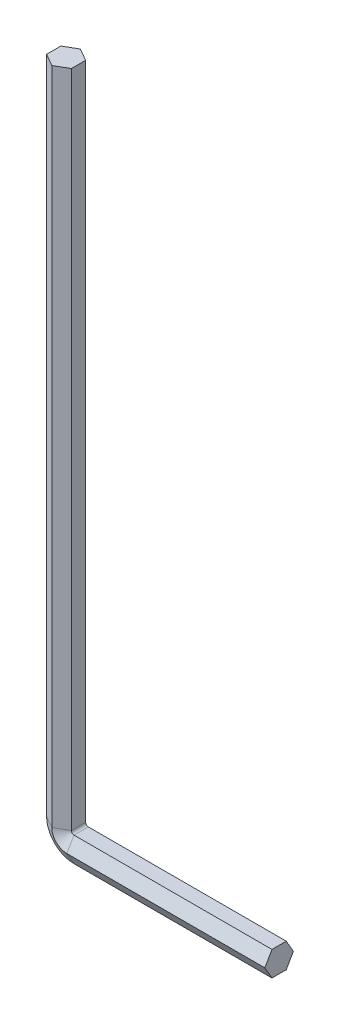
ISO-10303-21;
HEADER;
FILE_DESCRIPTION(('STEP AP214'),'2;1');
FILE_NAME('part.step','',(''),(''),'','','');
FILE_SCHEMA(('AUTOMOTIVE_DESIGN { 1 0 10303 214 1 1 1 1 }'));
ENDSEC;
DATA;
#1=APPLICATION_CONTEXT('core data for automotive mechanical design processes');
#2=APPLICATION_PROTOCOL_DEFINITION('international standard','automotive_design',2000,#1);
#3=PRODUCT_CONTEXT('',#1,'mechanical');
#4=PRODUCT('Part','Part','',(#3));
#5=PRODUCT_RELATED_PRODUCT_CATEGORY('part','',(#4));
#6=PRODUCT_DEFINITION_FORMATION('','',#4);
#7=PRODUCT_DEFINITION_CONTEXT('part definition',#1,'design');
#8=PRODUCT_DEFINITION('design','',#6,#7);
#9=PRODUCT_DEFINITION_SHAPE('','',#8);
#10=(LENGTH_UNIT() NAMED_UNIT(*) SI_UNIT(.MILLI.,.METRE.));
#11=(NAMED_UNIT(*) PLANE_ANGLE_UNIT() SI_UNIT($,.RADIAN.));
#12=(NAMED_UNIT(*) SI_UNIT($,.STERADIAN.) SOLID_ANGLE_UNIT());
#13=UNCERTAINTY_MEASURE_WITH_UNIT(LENGTH_MEASURE(1.E-05),#10,'distance_accuracy_value','');
#14=(GEOMETRIC_REPRESENTATION_CONTEXT(3) GLOBAL_UNCERTAINTY_ASSIGNED_CONTEXT((#13)) GLOBAL_UNIT_ASSIGNED_CONTEXT((#10,
#11,#12)) REPRESENTATION_CONTEXT('',''));
#15=CARTESIAN_POINT('',(0.,0.,0.));
#16=DIRECTION('',(0.,0.,1.));
#17=DIRECTION('',(1.,0.,0.));
#18=AXIS2_PLACEMENT_3D('',#15,#16,#17);
#19=CARTESIAN_POINT('',(-21.6857790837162,1.44515408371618,0.687407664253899));
#20=DIRECTION('',(1.,0.,0.));
#21=DIRECTION('',(0.,0.,-1.));
#22=AXIS2_PLACEMENT_3D('',#19,#20,#21);
#23=PLANE('',#22);
#24=DIRECTION('',(0.,0.,-1.));
#25=VECTOR('',#24,1.);
#26=CARTESIAN_POINT('',(-21.6857790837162,1.44515408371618,0.687407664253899));
#27=LINE('',#26,#25);
#28=CARTESIAN_POINT('',(-21.6857790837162,1.44515408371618,0.687407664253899));
#29=VERTEX_POINT('',#28);
#30=CARTESIAN_POINT('',(-21.6857790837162,1.44515408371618,-0.687407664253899));
#31=VERTEX_POINT('',#30);
#32=EDGE_CURVE('E195',#29,#31,#27,.T.);
#33=ORIENTED_EDGE('',*,*,#32,.F.);
#34=DIRECTION('',(0.,1.,0.));
#35=VECTOR('',#34,1.);
#36=CARTESIAN_POINT('',(-21.6857790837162,1.44515408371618,0.687407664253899));
#37=LINE('',#36,#35);
#38=CARTESIAN_POINT('',(-21.6857790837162,64.9451540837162,0.687407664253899));
#39=VERTEX_POINT('',#38);
#40=EDGE_CURVE('E38',#29,#39,#37,.T.);
#41=ORIENTED_EDGE('',*,*,#40,.T.);
#42=DIRECTION('',(0.,0.,-1.));
#43=VECTOR('',#42,1.);
#44=CARTESIAN_POINT('',(-21.6857790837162,64.9451540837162,0.687407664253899));
#45=LINE('',#44,#43);
#46=CARTESIAN_POINT('',(-21.6857790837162,64.9451540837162,-0.687407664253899));
#47=VERTEX_POINT('',#46);
#48=EDGE_CURVE('E45',#39,#47,#45,.T.);
#49=ORIENTED_EDGE('',*,*,#48,.T.);
#50=DIRECTION('',(0.,1.,0.));
#51=VECTOR('',#50,1.);
#52=CARTESIAN_POINT('',(-21.6857790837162,1.44515408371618,-0.687407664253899));
#53=LINE('',#52,#51);
#54=EDGE_CURVE('E11',#31,#47,#53,.T.);
#55=ORIENTED_EDGE('',*,*,#54,.F.);
#56=EDGE_LOOP('',(#33,#41,#49,#55));
#57=FACE_BOUND('',#56,.T.);
#58=ADVANCED_FACE('F31',(#57),#23,.F.);
#59=CARTESIAN_POINT('',(-20.4951540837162,1.44515408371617,1.3748153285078));
#60=DIRECTION('',(0.5,0.,-0.866025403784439));
#61=DIRECTION('',(-0.866025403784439,0.,-0.5));
#62=AXIS2_PLACEMENT_3D('',#59,#60,#61);
#63=PLANE('',#62);
#64=DIRECTION('',(-0.866025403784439,0.,-0.5));
#65=VECTOR('',#64,1.);
#66=CARTESIAN_POINT('',(-20.4951540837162,1.44515408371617,1.3748153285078));
#67=LINE('',#66,#65);
#68=CARTESIAN_POINT('',(-20.4951540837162,1.44515408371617,1.3748153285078));
#69=VERTEX_POINT('',#68);
#70=EDGE_CURVE('E192',#69,#29,#67,.T.);
#71=ORIENTED_EDGE('',*,*,#70,.F.);
#72=DIRECTION('',(0.,1.,0.));
#73=VECTOR('',#72,1.);
#74=CARTESIAN_POINT('',(-20.4951540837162,1.44515408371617,1.3748153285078));
#75=LINE('',#74,#73);
#76=CARTESIAN_POINT('',(-20.4951540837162,64.9451540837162,1.3748153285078));
#77=VERTEX_POINT('',#76);
#78=EDGE_CURVE('E235',#69,#77,#75,.T.);
#79=ORIENTED_EDGE('',*,*,#78,.T.);
#80=DIRECTION('',(-0.866025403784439,0.,-0.5));
#81=VECTOR('',#80,1.);
#82=CARTESIAN_POINT('',(-20.4951540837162,64.9451540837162,1.3748153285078));
#83=LINE('',#82,#81);
#84=EDGE_CURVE('E53',#77,#39,#83,.T.);
#85=ORIENTED_EDGE('',*,*,#84,.T.);
#86=ORIENTED_EDGE('',*,*,#40,.F.);
#87=EDGE_LOOP('',(#71,#79,#85,#86));
#88=FACE_BOUND('',#87,.T.);
#89=ADVANCED_FACE('F238',(#88),#63,.F.);
#90=CARTESIAN_POINT('',(-19.3045290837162,1.44515408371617,0.687407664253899));
#91=DIRECTION('',(-0.5,0.,-0.866025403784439));
#92=DIRECTION('',(-0.866025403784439,0.,0.5));
#93=AXIS2_PLACEMENT_3D('',#90,#91,#92);
#94=PLANE('',#93);
#95=DIRECTION('',(-0.866025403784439,0.,0.5));
#96=VECTOR('',#95,1.);
#97=CARTESIAN_POINT('',(-19.3045290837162,1.44515408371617,0.687407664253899));
#98=LINE('',#97,#96);
#99=CARTESIAN_POINT('',(-19.3045290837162,1.44515408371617,0.687407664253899));
#100=VERTEX_POINT('',#99);
#101=EDGE_CURVE('E189',#100,#69,#98,.T.);
#102=ORIENTED_EDGE('',*,*,#101,.F.);
#103=DIRECTION('',(0.,1.,0.));
#104=VECTOR('',#103,1.);
#105=CARTESIAN_POINT('',(-19.3045290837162,1.44515408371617,0.687407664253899));
#106=LINE('',#105,#104);
#107=CARTESIAN_POINT('',(-19.3045290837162,64.9451540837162,0.687407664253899));
#108=VERTEX_POINT('',#107);
#109=EDGE_CURVE('E232',#100,#108,#106,.T.);
#110=ORIENTED_EDGE('',*,*,#109,.T.);
#111=DIRECTION('',(-0.866025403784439,0.,0.5));
#112=VECTOR('',#111,1.);
#113=CARTESIAN_POINT('',(-19.3045290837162,64.9451540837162,0.687407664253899));
#114=LINE('',#113,#112);
#115=EDGE_CURVE('E222',#108,#77,#114,.T.);
#116=ORIENTED_EDGE('',*,*,#115,.T.);
#117=ORIENTED_EDGE('',*,*,#78,.F.);
#118=EDGE_LOOP('',(#102,#110,#116,#117));
#119=FACE_BOUND('',#118,.T.);
#120=ADVANCED_FACE('F293',(#119),#94,.F.);
#121=CARTESIAN_POINT('',(-19.3045290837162,1.44515408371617,-0.687407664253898));
#122=DIRECTION('',(-1.,0.,0.));
#123=DIRECTION('',(0.,0.,1.));
#124=AXIS2_PLACEMENT_3D('',#121,#122,#123);
#125=PLANE('',#124);
#126=DIRECTION('',(0.,0.,1.));
#127=VECTOR('',#126,1.);
#128=CARTESIAN_POINT('',(-19.3045290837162,1.44515408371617,-0.687407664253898));
#129=LINE('',#128,#127);
#130=CARTESIAN_POINT('',(-19.3045290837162,1.44515408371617,-0.687407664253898));
#131=VERTEX_POINT('',#130);
#132=EDGE_CURVE('E186',#131,#100,#129,.T.);
#133=ORIENTED_EDGE('',*,*,#132,.F.);
#134=DIRECTION('',(0.,1.,0.));
#135=VECTOR('',#134,1.);
#136=CARTESIAN_POINT('',(-19.3045290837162,1.44515408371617,-0.687407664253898));
#137=LINE('',#136,#135);
#138=CARTESIAN_POINT('',(-19.3045290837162,64.9451540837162,-0.687407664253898));
#139=VERTEX_POINT('',#138);
#140=EDGE_CURVE('E229',#131,#139,#137,.T.);
#141=ORIENTED_EDGE('',*,*,#140,.T.);
#142=DIRECTION('',(0.,0.,1.));
#143=VECTOR('',#142,1.);
#144=CARTESIAN_POINT('',(-19.3045290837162,64.9451540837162,-0.687407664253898));
#145=LINE('',#144,#143);
#146=EDGE_CURVE('E220',#139,#108,#145,.T.);
#147=ORIENTED_EDGE('',*,*,#146,.T.);
#148=ORIENTED_EDGE('',*,*,#109,.F.);
#149=EDGE_LOOP('',(#133,#141,#147,#148));
#150=FACE_BOUND('',#149,.T.);
#151=ADVANCED_FACE('F263',(#150),#125,.F.);
#152=CARTESIAN_POINT('',(-20.4951540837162,1.44515408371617,-1.3748153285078));
#153=DIRECTION('',(-0.5,0.,0.866025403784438));
#154=DIRECTION('',(0.866025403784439,0.,0.5));
#155=AXIS2_PLACEMENT_3D('',#152,#153,#154);
#156=PLANE('',#155);
#157=DIRECTION('',(0.866025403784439,0.,0.5));
#158=VECTOR('',#157,1.);
#159=CARTESIAN_POINT('',(-20.4951540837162,1.44515408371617,-1.3748153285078));
#160=LINE('',#159,#158);
#161=CARTESIAN_POINT('',(-20.4951540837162,1.44515408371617,-1.3748153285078));
#162=VERTEX_POINT('',#161);
#163=EDGE_CURVE('E183',#162,#131,#160,.T.);
#164=ORIENTED_EDGE('',*,*,#163,.F.);
#165=DIRECTION('',(0.,1.,0.));
#166=VECTOR('',#165,1.);
#167=CARTESIAN_POINT('',(-20.4951540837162,1.44515408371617,-1.3748153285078));
#168=LINE('',#167,#166);
#169=CARTESIAN_POINT('',(-20.4951540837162,64.9451540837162,-1.3748153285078));
#170=VERTEX_POINT('',#169);
#171=EDGE_CURVE('E226',#162,#170,#168,.T.);
#172=ORIENTED_EDGE('',*,*,#171,.T.);
#173=DIRECTION('',(0.866025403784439,0.,0.5));
#174=VECTOR('',#173,1.);
#175=CARTESIAN_POINT('',(-20.4951540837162,64.9451540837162,-1.3748153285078));
#176=LINE('',#175,#174);
#177=EDGE_CURVE('E218',#170,#139,#176,.T.);
#178=ORIENTED_EDGE('',*,*,#177,.T.);
#179=ORIENTED_EDGE('',*,*,#140,.F.);
#180=EDGE_LOOP('',(#164,#172,#178,#179));
#181=FACE_BOUND('',#180,.T.);
#182=ADVANCED_FACE('F269',(#181),#156,.F.);
#183=CARTESIAN_POINT('',(-21.6857790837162,1.44515408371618,-0.687407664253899));
#184=DIRECTION('',(0.5,0.,0.866025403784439));
#185=DIRECTION('',(0.866025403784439,0.,-0.5));
#186=AXIS2_PLACEMENT_3D('',#183,#184,#185);
#187=PLANE('',#186);
#188=DIRECTION('',(0.866025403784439,0.,-0.5));
#189=VECTOR('',#188,1.);
#190=CARTESIAN_POINT('',(-21.6857790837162,1.44515408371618,-0.687407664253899));
#191=LINE('',#190,#189);
#192=EDGE_CURVE('E173',#31,#162,#191,.T.);
#193=ORIENTED_EDGE('',*,*,#192,.F.);
#194=ORIENTED_EDGE('',*,*,#54,.T.);
#195=DIRECTION('',(0.866025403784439,0.,-0.5));
#196=VECTOR('',#195,1.);
#197=CARTESIAN_POINT('',(-21.6857790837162,64.9451540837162,-0.687407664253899));
#198=LINE('',#197,#196);
#199=EDGE_CURVE('E216',#47,#170,#198,.T.);
#200=ORIENTED_EDGE('',*,*,#199,.T.);
#201=ORIENTED_EDGE('',*,*,#171,.F.);
#202=EDGE_LOOP('',(#193,#194,#200,#201));
#203=FACE_BOUND('',#202,.T.);
#204=ADVANCED_FACE('F274',(#203),#187,.F.);
#205=CARTESIAN_POINT('',(-19.05,1.44515408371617,0.));
#206=DIRECTION('',(0.,0.,-1.));
#207=DIRECTION('',(-1.,0.,0.));
#208=AXIS2_PLACEMENT_3D('',#205,#206,#207);
#209=CYLINDRICAL_SURFACE('',#208,2.63577908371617);
#210=DIRECTION('',(0.,0.,-1.));
#211=VECTOR('',#210,1.);
#212=CARTESIAN_POINT('',(-19.05,-1.190625,0.687407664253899));
#213=LINE('',#212,#211);
#214=CARTESIAN_POINT('',(-19.05,-1.190625,0.687407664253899));
#215=VERTEX_POINT('',#214);
#216=CARTESIAN_POINT('',(-19.05,-1.190625,-0.687407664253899));
#217=VERTEX_POINT('',#216);
#218=EDGE_CURVE('E133',#215,#217,#213,.T.);
#219=ORIENTED_EDGE('',*,*,#218,.F.);
#220=CARTESIAN_POINT('',(-19.05,1.44515408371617,0.687407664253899));
#221=DIRECTION('',(0.,0.,-1.));
#222=DIRECTION('',(-1.,0.,0.));
#223=AXIS2_PLACEMENT_3D('',#220,#221,#222);
#224=CIRCLE('',#223,2.63577908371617);
#225=EDGE_CURVE('E210',#215,#29,#224,.T.);
#226=ORIENTED_EDGE('',*,*,#225,.T.);
#227=ORIENTED_EDGE('',*,*,#32,.T.);
#228=CARTESIAN_POINT('',(-19.05,1.44515408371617,-0.687407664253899));
#229=DIRECTION('',(0.,0.,-1.));
#230=DIRECTION('',(-1.,0.,0.));
#231=AXIS2_PLACEMENT_3D('',#228,#229,#230);
#232=CIRCLE('',#231,2.63577908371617);
#233=EDGE_CURVE('E213',#217,#31,#232,.T.);
#234=ORIENTED_EDGE('',*,*,#233,.F.);
#235=EDGE_LOOP('',(#219,#226,#227,#234));
#236=FACE_BOUND('',#235,.T.);
#237=ADVANCED_FACE('F276',(#236),#209,.T.);
#238=CARTESIAN_POINT('',(-19.05,1.44515408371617,1.3748153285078));
#239=DIRECTION('',(0.,0.,-1.));
#240=DIRECTION('',(-1.,0.,0.));
#241=AXIS2_PLACEMENT_3D('',#238,#239,#240);
#242=CONICAL_SURFACE('',#241,1.44515408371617,1.0471975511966);
#243=DIRECTION('',(0.,-0.866025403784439,-0.5));
#244=VECTOR('',#243,1.);
#245=CARTESIAN_POINT('',(-19.05,0.,1.3748153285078));
#246=LINE('',#245,#244);
#247=CARTESIAN_POINT('',(-19.05,0.,1.3748153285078));
#248=VERTEX_POINT('',#247);
#249=EDGE_CURVE('E166',#248,#215,#246,.T.);
#250=ORIENTED_EDGE('',*,*,#249,.F.);
#251=CARTESIAN_POINT('',(-19.05,1.44515408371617,1.3748153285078));
#252=DIRECTION('',(0.,0.,-1.));
#253=DIRECTION('',(-1.,0.,0.));
#254=AXIS2_PLACEMENT_3D('',#251,#252,#253);
#255=CIRCLE('',#254,1.44515408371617);
#256=EDGE_CURVE('E207',#248,#69,#255,.T.);
#257=ORIENTED_EDGE('',*,*,#256,.T.);
#258=ORIENTED_EDGE('',*,*,#70,.T.);
#259=ORIENTED_EDGE('',*,*,#225,.F.);
#260=EDGE_LOOP('',(#250,#257,#258,#259));
#261=FACE_BOUND('',#260,.T.);
#262=ADVANCED_FACE('F246',(#261),#242,.T.);
#263=CARTESIAN_POINT('',(-19.05,1.44515408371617,0.687407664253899));
#264=DIRECTION('',(0.,0.,1.));
#265=DIRECTION('',(1.,0.,0.));
#266=AXIS2_PLACEMENT_3D('',#263,#264,#265);
#267=CONICAL_SURFACE('',#266,0.254529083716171,1.0471975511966);
#268=DIRECTION('',(0.,-0.866025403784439,0.5));
#269=VECTOR('',#268,1.);
#270=CARTESIAN_POINT('',(-19.05,1.190625,0.687407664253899));
#271=LINE('',#270,#269);
#272=CARTESIAN_POINT('',(-19.05,1.190625,0.687407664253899));
#273=VERTEX_POINT('',#272);
#274=EDGE_CURVE('E163',#273,#248,#271,.T.);
#275=ORIENTED_EDGE('',*,*,#274,.F.);
#276=CARTESIAN_POINT('',(-19.05,1.44515408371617,0.687407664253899));
#277=DIRECTION('',(0.,0.,-1.));
#278=DIRECTION('',(-1.,0.,0.));
#279=AXIS2_PLACEMENT_3D('',#276,#277,#278);
#280=CIRCLE('',#279,0.254529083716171);
#281=EDGE_CURVE('E204',#273,#100,#280,.T.);
#282=ORIENTED_EDGE('',*,*,#281,.T.);
#283=ORIENTED_EDGE('',*,*,#101,.T.);
#284=ORIENTED_EDGE('',*,*,#256,.F.);
#285=EDGE_LOOP('',(#275,#282,#283,#284));
#286=FACE_BOUND('',#285,.T.);
#287=ADVANCED_FACE('F243',(#286),#267,.F.);
#288=CARTESIAN_POINT('',(-19.05,1.44515408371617,0.));
#289=DIRECTION('',(0.,0.,-1.));
#290=DIRECTION('',(-1.,0.,0.));
#291=AXIS2_PLACEMENT_3D('',#288,#289,#290);
#292=CYLINDRICAL_SURFACE('',#291,0.254529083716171);
#293=DIRECTION('',(0.,0.,1.));
#294=VECTOR('',#293,1.);
#295=CARTESIAN_POINT('',(-19.05,1.190625,-0.687407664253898));
#296=LINE('',#295,#294);
#297=CARTESIAN_POINT('',(-19.05,1.190625,-0.687407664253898));
#298=VERTEX_POINT('',#297);
#299=EDGE_CURVE('E160',#298,#273,#296,.T.);
#300=ORIENTED_EDGE('',*,*,#299,.F.);
#301=CARTESIAN_POINT('',(-19.05,1.44515408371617,-0.687407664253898));
#302=DIRECTION('',(0.,0.,-1.));
#303=DIRECTION('',(-1.,0.,0.));
#304=AXIS2_PLACEMENT_3D('',#301,#302,#303);
#305=CIRCLE('',#304,0.254529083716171);
#306=EDGE_CURVE('E201',#298,#131,#305,.T.);
#307=ORIENTED_EDGE('',*,*,#306,.T.);
#308=ORIENTED_EDGE('',*,*,#132,.T.);
#309=ORIENTED_EDGE('',*,*,#281,.F.);
#310=EDGE_LOOP('',(#300,#307,#308,#309));
#311=FACE_BOUND('',#310,.T.);
#312=ADVANCED_FACE('F260',(#311),#292,.F.);
#313=CARTESIAN_POINT('',(-19.05,1.44515408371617,-1.3748153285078));
#314=DIRECTION('',(0.,0.,-1.));
#315=DIRECTION('',(-1.,0.,0.));
#316=AXIS2_PLACEMENT_3D('',#313,#314,#315);
#317=CONICAL_SURFACE('',#316,1.44515408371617,1.0471975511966);
#318=DIRECTION('',(0.,0.866025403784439,0.5));
#319=VECTOR('',#318,1.);
#320=CARTESIAN_POINT('',(-19.05,0.,-1.3748153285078));
#321=LINE('',#320,#319);
#322=CARTESIAN_POINT('',(-19.05,0.,-1.3748153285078));
#323=VERTEX_POINT('',#322);
#324=EDGE_CURVE('E158',#323,#298,#321,.T.);
#325=ORIENTED_EDGE('',*,*,#324,.F.);
#326=CARTESIAN_POINT('',(-19.05,1.44515408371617,-1.3748153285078));
#327=DIRECTION('',(0.,0.,-1.));
#328=DIRECTION('',(-1.,0.,0.));
#329=AXIS2_PLACEMENT_3D('',#326,#327,#328);
#330=CIRCLE('',#329,1.44515408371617);
#331=EDGE_CURVE('E198',#323,#162,#330,.T.);
#332=ORIENTED_EDGE('',*,*,#331,.T.);
#333=ORIENTED_EDGE('',*,*,#163,.T.);
#334=ORIENTED_EDGE('',*,*,#306,.F.);
#335=EDGE_LOOP('',(#325,#332,#333,#334));
#336=FACE_BOUND('',#335,.T.);
#337=ADVANCED_FACE('F267',(#336),#317,.F.);
#338=CARTESIAN_POINT('',(-19.05,1.44515408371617,-0.687407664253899));
#339=DIRECTION('',(0.,0.,1.));
#340=DIRECTION('',(1.,0.,0.));
#341=AXIS2_PLACEMENT_3D('',#338,#339,#340);
#342=CONICAL_SURFACE('',#341,2.63577908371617,1.0471975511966);
#343=DIRECTION('',(0.,0.866025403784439,-0.5));
#344=VECTOR('',#343,1.);
#345=CARTESIAN_POINT('',(-19.05,-1.190625,-0.687407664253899));
#346=LINE('',#345,#344);
#347=EDGE_CURVE('E129',#217,#323,#346,.T.);
#348=ORIENTED_EDGE('',*,*,#347,.F.);
#349=ORIENTED_EDGE('',*,*,#233,.T.);
#350=ORIENTED_EDGE('',*,*,#192,.T.);
#351=ORIENTED_EDGE('',*,*,#331,.F.);
#352=EDGE_LOOP('',(#348,#349,#350,#351));
#353=FACE_BOUND('',#352,.T.);
#354=ADVANCED_FACE('F272',(#353),#342,.T.);
#355=CARTESIAN_POINT('',(-19.05,-1.190625,-0.687407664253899));
#356=DIRECTION('',(0.,-0.5,-0.866025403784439));
#357=DIRECTION('',(0.,0.866025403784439,-0.5));
#358=AXIS2_PLACEMENT_3D('',#355,#356,#357);
#359=PLANE('',#358);
#360=DIRECTION('',(0.,0.866025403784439,-0.5));
#361=VECTOR('',#360,1.);
#362=CARTESIAN_POINT('',(0.,-1.190625,-0.687407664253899));
#363=LINE('',#362,#361);
#364=CARTESIAN_POINT('',(0.,-1.190625,-0.687407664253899));
#365=VERTEX_POINT('',#364);
#366=CARTESIAN_POINT('',(0.,0.,-1.3748153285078));
#367=VERTEX_POINT('',#366);
#368=EDGE_CURVE('E126',#365,#367,#363,.T.);
#369=ORIENTED_EDGE('',*,*,#368,.F.);
#370=DIRECTION('',(1.,0.,0.));
#371=VECTOR('',#370,1.);
#372=CARTESIAN_POINT('',(-19.05,-1.190625,-0.687407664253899));
#373=LINE('',#372,#371);
#374=EDGE_CURVE('E171',#217,#365,#373,.T.);
#375=ORIENTED_EDGE('',*,*,#374,.F.);
#376=ORIENTED_EDGE('',*,*,#347,.T.);
#377=DIRECTION('',(1.,0.,0.));
#378=VECTOR('',#377,1.);
#379=CARTESIAN_POINT('',(-19.05,0.,-1.3748153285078));
#380=LINE('',#379,#378);
#381=EDGE_CURVE('E121',#323,#367,#380,.T.);
#382=ORIENTED_EDGE('',*,*,#381,.T.);
#383=EDGE_LOOP('',(#369,#375,#376,#382));
#384=FACE_BOUND('',#383,.T.);
#385=ADVANCED_FACE('F123',(#384),#359,.T.);
#386=CARTESIAN_POINT('',(-19.05,-1.190625,0.687407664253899));
#387=DIRECTION('',(0.,-1.,0.));
#388=DIRECTION('',(1.,0.,0.));
#389=AXIS2_PLACEMENT_3D('',#386,#387,#388);
#390=PLANE('',#389);
#391=DIRECTION('',(0.,0.,-1.));
#392=VECTOR('',#391,1.);
#393=CARTESIAN_POINT('',(0.,-1.190625,0.687407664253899));
#394=LINE('',#393,#392);
#395=CARTESIAN_POINT('',(0.,-1.190625,0.687407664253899));
#396=VERTEX_POINT('',#395);
#397=EDGE_CURVE('E147',#396,#365,#394,.T.);
#398=ORIENTED_EDGE('',*,*,#397,.F.);
#399=DIRECTION('',(1.,0.,0.));
#400=VECTOR('',#399,1.);
#401=CARTESIAN_POINT('',(-19.05,-1.190625,0.687407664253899));
#402=LINE('',#401,#400);
#403=EDGE_CURVE('E174',#215,#396,#402,.T.);
#404=ORIENTED_EDGE('',*,*,#403,.F.);
#405=ORIENTED_EDGE('',*,*,#218,.T.);
#406=ORIENTED_EDGE('',*,*,#374,.T.);
#407=EDGE_LOOP('',(#398,#404,#405,#406));
#408=FACE_BOUND('',#407,.T.);
#409=ADVANCED_FACE('F279',(#408),#390,.T.);
#410=CARTESIAN_POINT('',(-19.05,0.,1.3748153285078));
#411=DIRECTION('',(0.,-0.5,0.866025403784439));
#412=DIRECTION('',(0.,-0.866025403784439,-0.5));
#413=AXIS2_PLACEMENT_3D('',#410,#411,#412);
#414=PLANE('',#413);
#415=DIRECTION('',(0.,-0.866025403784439,-0.5));
#416=VECTOR('',#415,1.);
#417=CARTESIAN_POINT('',(0.,0.,1.3748153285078));
#418=LINE('',#417,#416);
#419=CARTESIAN_POINT('',(0.,0.,1.3748153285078));
#420=VERTEX_POINT('',#419);
#421=EDGE_CURVE('E154',#420,#396,#418,.T.);
#422=ORIENTED_EDGE('',*,*,#421,.F.);
#423=DIRECTION('',(1.,0.,0.));
#424=VECTOR('',#423,1.);
#425=CARTESIAN_POINT('',(-19.05,0.,1.3748153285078));
#426=LINE('',#425,#424);
#427=EDGE_CURVE('E176',#248,#420,#426,.T.);
#428=ORIENTED_EDGE('',*,*,#427,.F.);
#429=ORIENTED_EDGE('',*,*,#249,.T.);
#430=ORIENTED_EDGE('',*,*,#403,.T.);
#431=EDGE_LOOP('',(#422,#428,#429,#430));
#432=FACE_BOUND('',#431,.T.);
#433=ADVANCED_FACE('F251',(#432),#414,.T.);
#434=CARTESIAN_POINT('',(-19.05,1.190625,0.687407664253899));
#435=DIRECTION('',(0.,0.5,0.866025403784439));
#436=DIRECTION('',(0.,-0.866025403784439,0.5));
#437=AXIS2_PLACEMENT_3D('',#434,#435,#436);
#438=PLANE('',#437);
#439=DIRECTION('',(0.,-0.866025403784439,0.5));
#440=VECTOR('',#439,1.);
#441=CARTESIAN_POINT('',(0.,1.190625,0.687407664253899));
#442=LINE('',#441,#440);
#443=CARTESIAN_POINT('',(0.,1.190625,0.687407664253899));
#444=VERTEX_POINT('',#443);
#445=EDGE_CURVE('E151',#444,#420,#442,.T.);
#446=ORIENTED_EDGE('',*,*,#445,.F.);
#447=DIRECTION('',(1.,0.,0.));
#448=VECTOR('',#447,1.);
#449=CARTESIAN_POINT('',(-19.05,1.190625,0.687407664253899));
#450=LINE('',#449,#448);
#451=EDGE_CURVE('E178',#273,#444,#450,.T.);
#452=ORIENTED_EDGE('',*,*,#451,.F.);
#453=ORIENTED_EDGE('',*,*,#274,.T.);
#454=ORIENTED_EDGE('',*,*,#427,.T.);
#455=EDGE_LOOP('',(#446,#452,#453,#454));
#456=FACE_BOUND('',#455,.T.);
#457=ADVANCED_FACE('F255',(#456),#438,.T.);
#458=CARTESIAN_POINT('',(-19.05,1.190625,-0.687407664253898));
#459=DIRECTION('',(0.,1.,0.));
#460=DIRECTION('',(-1.,0.,0.));
#461=AXIS2_PLACEMENT_3D('',#458,#459,#460);
#462=PLANE('',#461);
#463=DIRECTION('',(0.,0.,1.));
#464=VECTOR('',#463,1.);
#465=CARTESIAN_POINT('',(0.,1.190625,-0.687407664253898));
#466=LINE('',#465,#464);
#467=CARTESIAN_POINT('',(0.,1.190625,-0.687407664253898));
#468=VERTEX_POINT('',#467);
#469=EDGE_CURVE('E142',#468,#444,#466,.T.);
#470=ORIENTED_EDGE('',*,*,#469,.F.);
#471=DIRECTION('',(1.,0.,0.));
#472=VECTOR('',#471,1.);
#473=CARTESIAN_POINT('',(-19.05,1.190625,-0.687407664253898));
#474=LINE('',#473,#472);
#475=EDGE_CURVE('E132',#298,#468,#474,.T.);
#476=ORIENTED_EDGE('',*,*,#475,.F.);
#477=ORIENTED_EDGE('',*,*,#299,.T.);
#478=ORIENTED_EDGE('',*,*,#451,.T.);
#479=EDGE_LOOP('',(#470,#476,#477,#478));
#480=FACE_BOUND('',#479,.T.);
#481=ADVANCED_FACE('F258',(#480),#462,.T.);
#482=CARTESIAN_POINT('',(-19.05,0.,-1.3748153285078));
#483=DIRECTION('',(0.,0.5,-0.866025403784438));
#484=DIRECTION('',(0.,0.866025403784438,0.5));
#485=AXIS2_PLACEMENT_3D('',#482,#483,#484);
#486=PLANE('',#485);
#487=DIRECTION('',(0.,0.866025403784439,0.5));
#488=VECTOR('',#487,1.);
#489=CARTESIAN_POINT('',(0.,0.,-1.3748153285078));
#490=LINE('',#489,#488);
#491=EDGE_CURVE('E136',#367,#468,#490,.T.);
#492=ORIENTED_EDGE('',*,*,#491,.F.);
#493=ORIENTED_EDGE('',*,*,#381,.F.);
#494=ORIENTED_EDGE('',*,*,#324,.T.);
#495=ORIENTED_EDGE('',*,*,#475,.T.);
#496=EDGE_LOOP('',(#492,#493,#494,#495));
#497=FACE_BOUND('',#496,.T.);
#498=ADVANCED_FACE('F137',(#497),#486,.T.);
#499=CARTESIAN_POINT('',(-19.3045290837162,64.9451540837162,-2.06222299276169));
#500=DIRECTION('',(0.,-1.,0.));
#501=DIRECTION('',(0.,0.,-1.));
#502=AXIS2_PLACEMENT_3D('',#499,#500,#501);
#503=PLANE('',#502);
#504=ORIENTED_EDGE('',*,*,#199,.F.);
#505=ORIENTED_EDGE('',*,*,#48,.F.);
#506=ORIENTED_EDGE('',*,*,#84,.F.);
#507=ORIENTED_EDGE('',*,*,#115,.F.);
#508=ORIENTED_EDGE('',*,*,#146,.F.);
#509=ORIENTED_EDGE('',*,*,#177,.F.);
#510=EDGE_LOOP('',(#504,#505,#506,#507,#508,#509));
#511=FACE_BOUND('',#510,.T.);
#512=ADVANCED_FACE('F319',(#511),#503,.F.);
#513=CARTESIAN_POINT('',(0.,1.190625,-2.06222299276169));
#514=DIRECTION('',(1.,0.,0.));
#515=DIRECTION('',(0.,0.,-1.));
#516=AXIS2_PLACEMENT_3D('',#513,#514,#515);
#517=PLANE('',#516);
#518=ORIENTED_EDGE('',*,*,#368,.T.);
#519=ORIENTED_EDGE('',*,*,#491,.T.);
#520=ORIENTED_EDGE('',*,*,#469,.T.);
#521=ORIENTED_EDGE('',*,*,#445,.T.);
#522=ORIENTED_EDGE('',*,*,#421,.T.);
#523=ORIENTED_EDGE('',*,*,#397,.T.);
#524=EDGE_LOOP('',(#518,#519,#520,#521,#522,#523));
#525=FACE_BOUND('',#524,.T.);
#526=ADVANCED_FACE('F144',(#525),#517,.T.);
#527=CLOSED_SHELL('',(#58,#89,#120,#151,#182,#204,#237,#262,#287,#312,#337,#354,#385,#409,#433,
#457,#481,#498,#512,#526));
#528=MANIFOLD_SOLID_BREP('B2',#527);
#529=ADVANCED_BREP_SHAPE_REPRESENTATION('',(#18,#528),#14);
#530=SHAPE_DEFINITION_REPRESENTATION(#9,#529);
ENDSEC;
END-ISO-10303-21;
